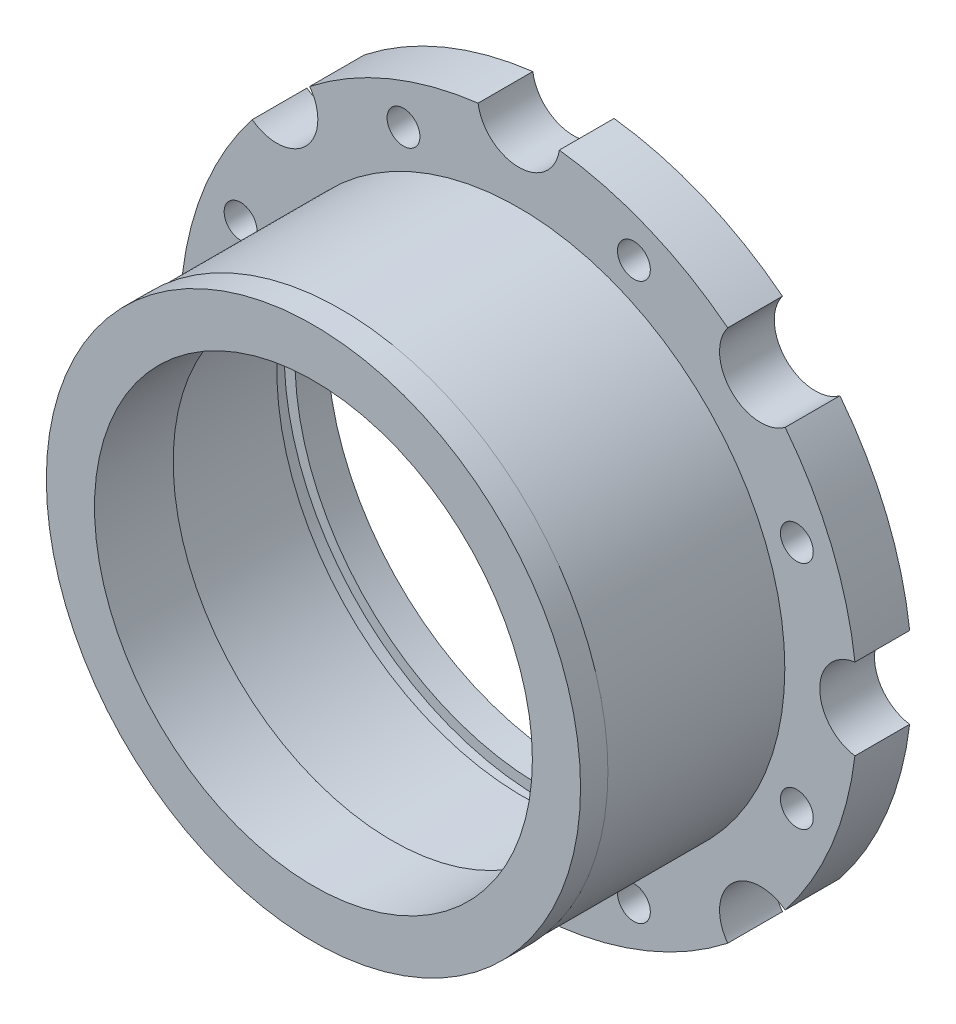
ISO-10303-21;
HEADER;
FILE_DESCRIPTION(('STEP AP214'),'2;1');
FILE_NAME('part.step','',(''),(''),'','','');
FILE_SCHEMA(('AUTOMOTIVE_DESIGN { 1 0 10303 214 1 1 1 1 }'));
ENDSEC;
DATA;
#1=APPLICATION_CONTEXT('core data for automotive mechanical design processes');
#2=APPLICATION_PROTOCOL_DEFINITION('international standard','automotive_design',2000,#1);
#3=PRODUCT_CONTEXT('',#1,'mechanical');
#4=PRODUCT('Part','Part','',(#3));
#5=PRODUCT_RELATED_PRODUCT_CATEGORY('part','',(#4));
#6=PRODUCT_DEFINITION_FORMATION('','',#4);
#7=PRODUCT_DEFINITION_CONTEXT('part definition',#1,'design');
#8=PRODUCT_DEFINITION('design','',#6,#7);
#9=PRODUCT_DEFINITION_SHAPE('','',#8);
#10=(LENGTH_UNIT() NAMED_UNIT(*) SI_UNIT(.MILLI.,.METRE.));
#11=(NAMED_UNIT(*) PLANE_ANGLE_UNIT() SI_UNIT($,.RADIAN.));
#12=(NAMED_UNIT(*) SI_UNIT($,.STERADIAN.) SOLID_ANGLE_UNIT());
#13=UNCERTAINTY_MEASURE_WITH_UNIT(LENGTH_MEASURE(1.E-05),#10,'distance_accuracy_value','');
#14=(GEOMETRIC_REPRESENTATION_CONTEXT(3) GLOBAL_UNCERTAINTY_ASSIGNED_CONTEXT((#13)) GLOBAL_UNIT_ASSIGNED_CONTEXT((#10,
#11,#12)) REPRESENTATION_CONTEXT('',''));
#15=CARTESIAN_POINT('',(0.,0.,0.));
#16=DIRECTION('',(0.,0.,1.));
#17=DIRECTION('',(1.,0.,0.));
#18=AXIS2_PLACEMENT_3D('',#15,#16,#17);
#19=CARTESIAN_POINT('',(0.,0.,4.7));
#20=DIRECTION('',(0.,0.,1.));
#21=DIRECTION('',(1.,0.,0.));
#22=AXIS2_PLACEMENT_3D('',#19,#20,#21);
#23=PLANE('',#22);
#24=CARTESIAN_POINT('',(0.,0.,4.7));
#25=DIRECTION('',(0.,0.,1.));
#26=DIRECTION('',(1.,0.,0.));
#27=AXIS2_PLACEMENT_3D('',#24,#25,#26);
#28=CIRCLE('',#27,36.);
#29=CARTESIAN_POINT('',(36.,0.,4.7));
#30=VERTEX_POINT('',#29);
#31=EDGE_CURVE('E9',#30,#30,#28,.T.);
#32=ORIENTED_EDGE('',*,*,#31,.F.);
#33=EDGE_LOOP('',(#32));
#34=FACE_BOUND('',#33,.T.);
#35=CARTESIAN_POINT('',(0.,0.,4.7));
#36=DIRECTION('',(0.,0.,1.));
#37=DIRECTION('',(1.,0.,0.));
#38=AXIS2_PLACEMENT_3D('',#35,#36,#37);
#39=CIRCLE('',#38,37.575);
#40=CARTESIAN_POINT('',(37.575,0.,4.7));
#41=VERTEX_POINT('',#40);
#42=EDGE_CURVE('E41',#41,#41,#39,.T.);
#43=ORIENTED_EDGE('',*,*,#42,.T.);
#44=EDGE_LOOP('',(#43));
#45=FACE_BOUND('',#44,.T.);
#46=ADVANCED_FACE('F15',(#34,#45),#23,.T.);
#47=CARTESIAN_POINT('',(0.,0.,-0.1));
#48=DIRECTION('',(0.,0.,1.));
#49=DIRECTION('',(1.,0.,0.));
#50=AXIS2_PLACEMENT_3D('',#47,#48,#49);
#51=CYLINDRICAL_SURFACE('',#50,36.);
#52=DIRECTION('',(0.,0.,1.));
#53=VECTOR('',#52,1.);
#54=CARTESIAN_POINT('',(36.,0.,-0.1));
#55=LINE('',#54,#53);
#56=CARTESIAN_POINT('',(36.,0.,0.));
#57=VERTEX_POINT('',#56);
#58=EDGE_CURVE('E18',#57,#30,#55,.T.);
#59=ORIENTED_EDGE('',*,*,#58,.T.);
#60=ORIENTED_EDGE('',*,*,#31,.T.);
#61=ORIENTED_EDGE('',*,*,#58,.F.);
#62=CARTESIAN_POINT('',(0.,0.,0.));
#63=DIRECTION('',(0.,0.,1.));
#64=DIRECTION('',(1.,0.,0.));
#65=AXIS2_PLACEMENT_3D('',#62,#63,#64);
#66=CIRCLE('',#65,36.);
#67=EDGE_CURVE('E446',#57,#57,#66,.T.);
#68=ORIENTED_EDGE('',*,*,#67,.F.);
#69=EDGE_LOOP('',(#59,#60,#61,#68));
#70=FACE_BOUND('',#69,.T.);
#71=ADVANCED_FACE('F528',(#70),#51,.F.);
#72=CARTESIAN_POINT('',(0.,0.,4.7));
#73=DIRECTION('',(0.,0.,1.));
#74=DIRECTION('',(1.,0.,0.));
#75=AXIS2_PLACEMENT_3D('',#72,#73,#74);
#76=CYLINDRICAL_SURFACE('',#75,37.575);
#77=DIRECTION('',(0.,0.,1.));
#78=VECTOR('',#77,1.);
#79=CARTESIAN_POINT('',(37.575,0.,4.7));
#80=LINE('',#79,#78);
#81=CARTESIAN_POINT('',(37.575,0.,7.35));
#82=VERTEX_POINT('',#81);
#83=EDGE_CURVE('E450',#41,#82,#80,.T.);
#84=ORIENTED_EDGE('',*,*,#83,.F.);
#85=ORIENTED_EDGE('',*,*,#42,.F.);
#86=ORIENTED_EDGE('',*,*,#83,.T.);
#87=CARTESIAN_POINT('',(0.,0.,7.35));
#88=DIRECTION('',(0.,0.,1.));
#89=DIRECTION('',(1.,0.,0.));
#90=AXIS2_PLACEMENT_3D('',#87,#88,#89);
#91=CIRCLE('',#90,37.575);
#92=EDGE_CURVE('E451',#82,#82,#91,.T.);
#93=ORIENTED_EDGE('',*,*,#92,.T.);
#94=EDGE_LOOP('',(#84,#85,#86,#93));
#95=FACE_BOUND('',#94,.T.);
#96=ADVANCED_FACE('F535',(#95),#76,.F.);
#97=CARTESIAN_POINT('',(0.,0.,0.));
#98=DIRECTION('',(0.,0.,1.));
#99=DIRECTION('',(1.,0.,0.));
#100=AXIS2_PLACEMENT_3D('',#97,#98,#99);
#101=PLANE('',#100);
#102=CARTESIAN_POINT('',(16.838071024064,40.650699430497,0.));
#103=DIRECTION('',(0.,0.,1.));
#104=DIRECTION('',(1.,0.,0.));
#105=AXIS2_PLACEMENT_3D('',#102,#103,#104);
#106=CIRCLE('',#105,2.4);
#107=CARTESIAN_POINT('',(19.238071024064,40.650699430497,0.));
#108=VERTEX_POINT('',#107);
#109=EDGE_CURVE('E431',#108,#108,#106,.T.);
#110=ORIENTED_EDGE('',*,*,#109,.T.);
#111=EDGE_LOOP('',(#110));
#112=FACE_BOUND('',#111,.T.);
#113=CARTESIAN_POINT('',(40.650699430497,16.838071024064,0.));
#114=DIRECTION('',(0.,0.,1.));
#115=DIRECTION('',(1.,0.,0.));
#116=AXIS2_PLACEMENT_3D('',#113,#114,#115);
#117=CIRCLE('',#116,2.4);
#118=CARTESIAN_POINT('',(43.050699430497,16.838071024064,0.));
#119=VERTEX_POINT('',#118);
#120=EDGE_CURVE('E435',#119,#119,#117,.T.);
#121=ORIENTED_EDGE('',*,*,#120,.T.);
#122=EDGE_LOOP('',(#121));
#123=FACE_BOUND('',#122,.T.);
#124=ORIENTED_EDGE('',*,*,#67,.T.);
#125=EDGE_LOOP('',(#124));
#126=FACE_BOUND('',#125,.T.);
#127=CARTESIAN_POINT('',(-16.83807102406,40.650699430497,0.));
#128=DIRECTION('',(0.,0.,1.));
#129=DIRECTION('',(1.,0.,0.));
#130=AXIS2_PLACEMENT_3D('',#127,#128,#129);
#131=CIRCLE('',#130,2.4);
#132=CARTESIAN_POINT('',(-14.43807102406,40.650699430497,0.));
#133=VERTEX_POINT('',#132);
#134=EDGE_CURVE('E509',#133,#133,#131,.T.);
#135=ORIENTED_EDGE('',*,*,#134,.T.);
#136=EDGE_LOOP('',(#135));
#137=FACE_BOUND('',#136,.T.);
#138=CARTESIAN_POINT('',(-40.65069943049,16.838071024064,0.));
#139=DIRECTION('',(0.,0.,1.));
#140=DIRECTION('',(1.,0.,0.));
#141=AXIS2_PLACEMENT_3D('',#138,#139,#140);
#142=CIRCLE('',#141,2.4);
#143=CARTESIAN_POINT('',(-38.25069943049,16.838071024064,0.));
#144=VERTEX_POINT('',#143);
#145=EDGE_CURVE('E318',#144,#144,#142,.T.);
#146=ORIENTED_EDGE('',*,*,#145,.T.);
#147=EDGE_LOOP('',(#146));
#148=FACE_BOUND('',#147,.T.);
#149=CARTESIAN_POINT('',(40.650699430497,-16.83807102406,0.));
#150=DIRECTION('',(0.,0.,1.));
#151=DIRECTION('',(1.,0.,0.));
#152=AXIS2_PLACEMENT_3D('',#149,#150,#151);
#153=CIRCLE('',#152,2.4);
#154=CARTESIAN_POINT('',(43.050699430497,-16.83807102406,0.));
#155=VERTEX_POINT('',#154);
#156=EDGE_CURVE('E360',#155,#155,#153,.T.);
#157=ORIENTED_EDGE('',*,*,#156,.T.);
#158=EDGE_LOOP('',(#157));
#159=FACE_BOUND('',#158,.T.);
#160=CARTESIAN_POINT('',(16.838071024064,-40.65069943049,0.));
#161=DIRECTION('',(0.,0.,1.));
#162=DIRECTION('',(1.,0.,0.));
#163=AXIS2_PLACEMENT_3D('',#160,#161,#162);
#164=CIRCLE('',#163,2.4);
#165=CARTESIAN_POINT('',(19.238071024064,-40.65069943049,0.));
#166=VERTEX_POINT('',#165);
#167=EDGE_CURVE('E365',#166,#166,#164,.T.);
#168=ORIENTED_EDGE('',*,*,#167,.T.);
#169=EDGE_LOOP('',(#168));
#170=FACE_BOUND('',#169,.T.);
#171=CARTESIAN_POINT('',(-40.65069943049,-16.83807102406,0.));
#172=DIRECTION('',(0.,0.,1.));
#173=DIRECTION('',(1.,0.,0.));
#174=AXIS2_PLACEMENT_3D('',#171,#172,#173);
#175=CIRCLE('',#174,2.4);
#176=CARTESIAN_POINT('',(-38.25069943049,-16.83807102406,0.));
#177=VERTEX_POINT('',#176);
#178=EDGE_CURVE('E364',#177,#177,#175,.T.);
#179=ORIENTED_EDGE('',*,*,#178,.T.);
#180=EDGE_LOOP('',(#179));
#181=FACE_BOUND('',#180,.T.);
#182=CARTESIAN_POINT('',(-16.83807102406,-40.65069943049,0.));
#183=DIRECTION('',(0.,0.,1.));
#184=DIRECTION('',(1.,0.,0.));
#185=AXIS2_PLACEMENT_3D('',#182,#183,#184);
#186=CIRCLE('',#185,2.4);
#187=CARTESIAN_POINT('',(-14.43807102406,-40.65069943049,0.));
#188=VERTEX_POINT('',#187);
#189=EDGE_CURVE('E373',#188,#188,#186,.T.);
#190=ORIENTED_EDGE('',*,*,#189,.T.);
#191=EDGE_LOOP('',(#190));
#192=FACE_BOUND('',#191,.T.);
#193=CARTESIAN_POINT('',(0.,0.,0.));
#194=DIRECTION('',(0.,0.,1.));
#195=DIRECTION('',(1.,0.,0.));
#196=AXIS2_PLACEMENT_3D('',#193,#194,#195);
#197=CIRCLE('',#196,49.5);
#198=CARTESIAN_POINT('',(38.94808380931,-30.54990617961,0.));
#199=VERTEX_POINT('',#198);
#200=CARTESIAN_POINT('',(49.1425,-5.93840835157,0.));
#201=VERTEX_POINT('',#200);
#202=EDGE_CURVE('E413',#199,#201,#197,.T.);
#203=ORIENTED_EDGE('',*,*,#202,.F.);
#204=CARTESIAN_POINT('',(35.355339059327,-35.35533905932,0.));
#205=DIRECTION('',(0.,0.,1.));
#206=DIRECTION('',(1.,0.,0.));
#207=AXIS2_PLACEMENT_3D('',#204,#205,#206);
#208=CIRCLE('',#207,6.);
#209=CARTESIAN_POINT('',(30.54990617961,-38.94808380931,0.));
#210=VERTEX_POINT('',#209);
#211=EDGE_CURVE('E420',#199,#210,#208,.T.);
#212=ORIENTED_EDGE('',*,*,#211,.T.);
#213=CARTESIAN_POINT('',(0.,0.,0.));
#214=DIRECTION('',(0.,0.,1.));
#215=DIRECTION('',(1.,0.,0.));
#216=AXIS2_PLACEMENT_3D('',#213,#214,#215);
#217=CIRCLE('',#216,49.5);
#218=CARTESIAN_POINT('',(5.93840835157,-49.1425,0.));
#219=VERTEX_POINT('',#218);
#220=EDGE_CURVE('E385',#219,#210,#217,.T.);
#221=ORIENTED_EDGE('',*,*,#220,.F.);
#222=CARTESIAN_POINT('',(0.,-50.,0.));
#223=DIRECTION('',(0.,0.,1.));
#224=DIRECTION('',(1.,0.,0.));
#225=AXIS2_PLACEMENT_3D('',#222,#223,#224);
#226=CIRCLE('',#225,6.);
#227=CARTESIAN_POINT('',(-5.93840835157,-49.1425,0.));
#228=VERTEX_POINT('',#227);
#229=EDGE_CURVE('E381',#219,#228,#226,.T.);
#230=ORIENTED_EDGE('',*,*,#229,.T.);
#231=CARTESIAN_POINT('',(0.,0.,0.));
#232=DIRECTION('',(0.,0.,1.));
#233=DIRECTION('',(1.,0.,0.));
#234=AXIS2_PLACEMENT_3D('',#231,#232,#233);
#235=CIRCLE('',#234,49.5);
#236=CARTESIAN_POINT('',(-30.54990617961,-38.94808380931,0.));
#237=VERTEX_POINT('',#236);
#238=EDGE_CURVE('E438',#237,#228,#235,.T.);
#239=ORIENTED_EDGE('',*,*,#238,.F.);
#240=CARTESIAN_POINT('',(-35.35533905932,-35.35533905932,0.));
#241=DIRECTION('',(0.,0.,-1.));
#242=DIRECTION('',(-0.598790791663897,0.800905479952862,0.));
#243=AXIS2_PLACEMENT_3D('',#240,#241,#242);
#244=CIRCLE('',#243,6.);
#245=CARTESIAN_POINT('',(-38.94808380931,-30.54990617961,0.));
#246=VERTEX_POINT('',#245);
#247=EDGE_CURVE('E443',#246,#237,#244,.T.);
#248=ORIENTED_EDGE('',*,*,#247,.F.);
#249=CARTESIAN_POINT('',(0.,0.,0.));
#250=DIRECTION('',(0.,0.,1.));
#251=DIRECTION('',(1.,0.,0.));
#252=AXIS2_PLACEMENT_3D('',#249,#250,#251);
#253=CIRCLE('',#252,49.5);
#254=CARTESIAN_POINT('',(-49.1425,-5.93840835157,0.));
#255=VERTEX_POINT('',#254);
#256=EDGE_CURVE('E457',#255,#246,#253,.T.);
#257=ORIENTED_EDGE('',*,*,#256,.F.);
#258=CARTESIAN_POINT('',(-50.,0.,0.));
#259=DIRECTION('',(0.,0.,-1.));
#260=DIRECTION('',(0.142916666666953,0.989734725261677,0.));
#261=AXIS2_PLACEMENT_3D('',#258,#259,#260);
#262=CIRCLE('',#261,6.);
#263=CARTESIAN_POINT('',(-49.1425,5.93840835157,0.));
#264=VERTEX_POINT('',#263);
#265=EDGE_CURVE('E458',#264,#255,#262,.T.);
#266=ORIENTED_EDGE('',*,*,#265,.F.);
#267=CARTESIAN_POINT('',(0.,0.,0.));
#268=DIRECTION('',(0.,0.,1.));
#269=DIRECTION('',(1.,0.,0.));
#270=AXIS2_PLACEMENT_3D('',#267,#268,#269);
#271=CIRCLE('',#270,49.5);
#272=CARTESIAN_POINT('',(-38.94808380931,30.54990617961,0.));
#273=VERTEX_POINT('',#272);
#274=EDGE_CURVE('E462',#273,#264,#271,.T.);
#275=ORIENTED_EDGE('',*,*,#274,.F.);
#276=CARTESIAN_POINT('',(-35.35533905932,35.355339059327,0.));
#277=DIRECTION('',(0.,0.,-1.));
#278=DIRECTION('',(0.800905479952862,0.598790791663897,0.));
#279=AXIS2_PLACEMENT_3D('',#276,#277,#278);
#280=CIRCLE('',#279,6.);
#281=CARTESIAN_POINT('',(-30.54990617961,38.94808380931,0.));
#282=VERTEX_POINT('',#281);
#283=EDGE_CURVE('E287',#282,#273,#280,.T.);
#284=ORIENTED_EDGE('',*,*,#283,.F.);
#285=CARTESIAN_POINT('',(0.,0.,0.));
#286=DIRECTION('',(0.,0.,1.));
#287=DIRECTION('',(1.,0.,0.));
#288=AXIS2_PLACEMENT_3D('',#285,#286,#287);
#289=CIRCLE('',#288,49.5);
#290=CARTESIAN_POINT('',(-5.93840835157,49.1425,0.));
#291=VERTEX_POINT('',#290);
#292=EDGE_CURVE('E288',#291,#282,#289,.T.);
#293=ORIENTED_EDGE('',*,*,#292,.F.);
#294=CARTESIAN_POINT('',(0.,50.,0.));
#295=DIRECTION('',(0.,0.,1.));
#296=DIRECTION('',(1.,0.,0.));
#297=AXIS2_PLACEMENT_3D('',#294,#295,#296);
#298=CIRCLE('',#297,6.);
#299=CARTESIAN_POINT('',(5.93840835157,49.1425,0.));
#300=VERTEX_POINT('',#299);
#301=EDGE_CURVE('E283',#291,#300,#298,.T.);
#302=ORIENTED_EDGE('',*,*,#301,.T.);
#303=CARTESIAN_POINT('',(0.,0.,0.));
#304=DIRECTION('',(0.,0.,1.));
#305=DIRECTION('',(1.,0.,0.));
#306=AXIS2_PLACEMENT_3D('',#303,#304,#305);
#307=CIRCLE('',#306,49.5);
#308=CARTESIAN_POINT('',(30.54990617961,38.94808380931,0.));
#309=VERTEX_POINT('',#308);
#310=EDGE_CURVE('E483',#309,#300,#307,.T.);
#311=ORIENTED_EDGE('',*,*,#310,.F.);
#312=CARTESIAN_POINT('',(35.355339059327,35.355339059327,0.));
#313=DIRECTION('',(0.,0.,1.));
#314=DIRECTION('',(1.,0.,0.));
#315=AXIS2_PLACEMENT_3D('',#312,#313,#314);
#316=CIRCLE('',#315,6.);
#317=CARTESIAN_POINT('',(38.94808380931,30.54990617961,0.));
#318=VERTEX_POINT('',#317);
#319=EDGE_CURVE('E487',#309,#318,#316,.T.);
#320=ORIENTED_EDGE('',*,*,#319,.T.);
#321=CARTESIAN_POINT('',(0.,0.,0.));
#322=DIRECTION('',(0.,0.,1.));
#323=DIRECTION('',(1.,0.,0.));
#324=AXIS2_PLACEMENT_3D('',#321,#322,#323);
#325=CIRCLE('',#324,49.5);
#326=CARTESIAN_POINT('',(49.1425,5.93840835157,0.));
#327=VERTEX_POINT('',#326);
#328=EDGE_CURVE('E492',#327,#318,#325,.T.);
#329=ORIENTED_EDGE('',*,*,#328,.F.);
#330=CARTESIAN_POINT('',(50.,0.,0.));
#331=DIRECTION('',(0.,0.,1.));
#332=DIRECTION('',(1.,0.,0.));
#333=AXIS2_PLACEMENT_3D('',#330,#331,#332);
#334=CIRCLE('',#333,6.);
#335=EDGE_CURVE('E337',#327,#201,#334,.T.);
#336=ORIENTED_EDGE('',*,*,#335,.T.);
#337=EDGE_LOOP('',(#203,#212,#221,#230,#239,#248,#257,#266,#275,#284,#293,#302,#311,#320,#329,#336));
#338=FACE_BOUND('',#337,.T.);
#339=ADVANCED_FACE('F526',(#112,#123,#126,#137,#148,#159,#170,#181,#192,#338),#101,.F.);
#340=CARTESIAN_POINT('',(0.,0.,7.35));
#341=DIRECTION('',(0.,0.,1.));
#342=DIRECTION('',(1.,0.,0.));
#343=AXIS2_PLACEMENT_3D('',#340,#341,#342);
#344=PLANE('',#343);
#345=CARTESIAN_POINT('',(0.,0.,7.35));
#346=DIRECTION('',(0.,0.,1.));
#347=DIRECTION('',(1.,0.,0.));
#348=AXIS2_PLACEMENT_3D('',#345,#346,#347);
#349=CIRCLE('',#348,36.);
#350=CARTESIAN_POINT('',(36.,0.,7.35));
#351=VERTEX_POINT('',#350);
#352=EDGE_CURVE('E406',#351,#351,#349,.T.);
#353=ORIENTED_EDGE('',*,*,#352,.T.);
#354=EDGE_LOOP('',(#353));
#355=FACE_BOUND('',#354,.T.);
#356=ORIENTED_EDGE('',*,*,#92,.F.);
#357=EDGE_LOOP('',(#356));
#358=FACE_BOUND('',#357,.T.);
#359=ADVANCED_FACE('F533',(#355,#358),#344,.F.);
#360=CARTESIAN_POINT('',(16.838071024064,40.650699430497,-0.1));
#361=DIRECTION('',(0.,0.,1.));
#362=DIRECTION('',(1.,0.,0.));
#363=AXIS2_PLACEMENT_3D('',#360,#361,#362);
#364=CYLINDRICAL_SURFACE('',#363,2.4);
#365=DIRECTION('',(0.,0.,1.));
#366=VECTOR('',#365,1.);
#367=CARTESIAN_POINT('',(19.238071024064,40.650699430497,-0.1));
#368=LINE('',#367,#366);
#369=CARTESIAN_POINT('',(19.238071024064,40.650699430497,8.));
#370=VERTEX_POINT('',#369);
#371=EDGE_CURVE('E428',#108,#370,#368,.T.);
#372=ORIENTED_EDGE('',*,*,#371,.F.);
#373=ORIENTED_EDGE('',*,*,#109,.F.);
#374=ORIENTED_EDGE('',*,*,#371,.T.);
#375=CARTESIAN_POINT('',(16.838071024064,40.650699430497,8.));
#376=DIRECTION('',(0.,0.,1.));
#377=DIRECTION('',(1.,0.,0.));
#378=AXIS2_PLACEMENT_3D('',#375,#376,#377);
#379=CIRCLE('',#378,2.4);
#380=EDGE_CURVE('E397',#370,#370,#379,.T.);
#381=ORIENTED_EDGE('',*,*,#380,.T.);
#382=EDGE_LOOP('',(#372,#373,#374,#381));
#383=FACE_BOUND('',#382,.T.);
#384=ADVANCED_FACE('F711',(#383),#364,.F.);
#385=CARTESIAN_POINT('',(40.650699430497,16.838071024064,-0.1));
#386=DIRECTION('',(0.,0.,1.));
#387=DIRECTION('',(1.,0.,0.));
#388=AXIS2_PLACEMENT_3D('',#385,#386,#387);
#389=CYLINDRICAL_SURFACE('',#388,2.4);
#390=DIRECTION('',(0.,0.,1.));
#391=VECTOR('',#390,1.);
#392=CARTESIAN_POINT('',(43.050699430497,16.838071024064,-0.1));
#393=LINE('',#392,#391);
#394=CARTESIAN_POINT('',(43.050699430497,16.838071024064,8.));
#395=VERTEX_POINT('',#394);
#396=EDGE_CURVE('E512',#119,#395,#393,.T.);
#397=ORIENTED_EDGE('',*,*,#396,.F.);
#398=ORIENTED_EDGE('',*,*,#120,.F.);
#399=ORIENTED_EDGE('',*,*,#396,.T.);
#400=CARTESIAN_POINT('',(40.650699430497,16.838071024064,8.));
#401=DIRECTION('',(0.,0.,1.));
#402=DIRECTION('',(1.,0.,0.));
#403=AXIS2_PLACEMENT_3D('',#400,#401,#402);
#404=CIRCLE('',#403,2.4);
#405=EDGE_CURVE('E398',#395,#395,#404,.T.);
#406=ORIENTED_EDGE('',*,*,#405,.T.);
#407=EDGE_LOOP('',(#397,#398,#399,#406));
#408=FACE_BOUND('',#407,.T.);
#409=ADVANCED_FACE('F714',(#408),#389,.F.);
#410=CARTESIAN_POINT('',(-16.83807102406,40.650699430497,-0.1));
#411=DIRECTION('',(0.,0.,1.));
#412=DIRECTION('',(1.,0.,0.));
#413=AXIS2_PLACEMENT_3D('',#410,#411,#412);
#414=CYLINDRICAL_SURFACE('',#413,2.4);
#415=DIRECTION('',(0.,0.,1.));
#416=VECTOR('',#415,1.);
#417=CARTESIAN_POINT('',(-14.43807102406,40.650699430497,-0.1));
#418=LINE('',#417,#416);
#419=CARTESIAN_POINT('',(-14.43807102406,40.650699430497,8.));
#420=VERTEX_POINT('',#419);
#421=EDGE_CURVE('E321',#133,#420,#418,.T.);
#422=ORIENTED_EDGE('',*,*,#421,.F.);
#423=ORIENTED_EDGE('',*,*,#134,.F.);
#424=ORIENTED_EDGE('',*,*,#421,.T.);
#425=CARTESIAN_POINT('',(-16.83807102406,40.650699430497,8.));
#426=DIRECTION('',(0.,0.,1.));
#427=DIRECTION('',(1.,0.,0.));
#428=AXIS2_PLACEMENT_3D('',#425,#426,#427);
#429=CIRCLE('',#428,2.4);
#430=EDGE_CURVE('E393',#420,#420,#429,.T.);
#431=ORIENTED_EDGE('',*,*,#430,.T.);
#432=EDGE_LOOP('',(#422,#423,#424,#431));
#433=FACE_BOUND('',#432,.T.);
#434=ADVANCED_FACE('F716',(#433),#414,.F.);
#435=CARTESIAN_POINT('',(-40.65069943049,16.838071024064,-0.1));
#436=DIRECTION('',(0.,0.,1.));
#437=DIRECTION('',(1.,0.,0.));
#438=AXIS2_PLACEMENT_3D('',#435,#436,#437);
#439=CYLINDRICAL_SURFACE('',#438,2.4);
#440=DIRECTION('',(0.,0.,1.));
#441=VECTOR('',#440,1.);
#442=CARTESIAN_POINT('',(-38.25069943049,16.838071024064,-0.1));
#443=LINE('',#442,#441);
#444=CARTESIAN_POINT('',(-38.25069943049,16.838071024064,8.));
#445=VERTEX_POINT('',#444);
#446=EDGE_CURVE('E325',#144,#445,#443,.T.);
#447=ORIENTED_EDGE('',*,*,#446,.F.);
#448=ORIENTED_EDGE('',*,*,#145,.F.);
#449=ORIENTED_EDGE('',*,*,#446,.T.);
#450=CARTESIAN_POINT('',(-40.65069943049,16.838071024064,8.));
#451=DIRECTION('',(0.,0.,1.));
#452=DIRECTION('',(1.,0.,0.));
#453=AXIS2_PLACEMENT_3D('',#450,#451,#452);
#454=CIRCLE('',#453,2.4);
#455=EDGE_CURVE('E388',#445,#445,#454,.T.);
#456=ORIENTED_EDGE('',*,*,#455,.T.);
#457=EDGE_LOOP('',(#447,#448,#449,#456));
#458=FACE_BOUND('',#457,.T.);
#459=ADVANCED_FACE('F724',(#458),#439,.F.);
#460=CARTESIAN_POINT('',(40.650699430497,-16.83807102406,-0.1));
#461=DIRECTION('',(0.,0.,1.));
#462=DIRECTION('',(1.,0.,0.));
#463=AXIS2_PLACEMENT_3D('',#460,#461,#462);
#464=CYLINDRICAL_SURFACE('',#463,2.4);
#465=DIRECTION('',(0.,0.,1.));
#466=VECTOR('',#465,1.);
#467=CARTESIAN_POINT('',(43.050699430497,-16.83807102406,-0.1));
#468=LINE('',#467,#466);
#469=CARTESIAN_POINT('',(43.050699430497,-16.83807102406,8.));
#470=VERTEX_POINT('',#469);
#471=EDGE_CURVE('E359',#155,#470,#468,.T.);
#472=ORIENTED_EDGE('',*,*,#471,.F.);
#473=ORIENTED_EDGE('',*,*,#156,.F.);
#474=ORIENTED_EDGE('',*,*,#471,.T.);
#475=CARTESIAN_POINT('',(40.650699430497,-16.83807102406,8.));
#476=DIRECTION('',(0.,0.,1.));
#477=DIRECTION('',(1.,0.,0.));
#478=AXIS2_PLACEMENT_3D('',#475,#476,#477);
#479=CIRCLE('',#478,2.4);
#480=EDGE_CURVE('E387',#470,#470,#479,.T.);
#481=ORIENTED_EDGE('',*,*,#480,.T.);
#482=EDGE_LOOP('',(#472,#473,#474,#481));
#483=FACE_BOUND('',#482,.T.);
#484=ADVANCED_FACE('F730',(#483),#464,.F.);
#485=CARTESIAN_POINT('',(16.838071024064,-40.65069943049,-0.1));
#486=DIRECTION('',(0.,0.,1.));
#487=DIRECTION('',(1.,0.,0.));
#488=AXIS2_PLACEMENT_3D('',#485,#486,#487);
#489=CYLINDRICAL_SURFACE('',#488,2.4);
#490=DIRECTION('',(0.,0.,1.));
#491=VECTOR('',#490,1.);
#492=CARTESIAN_POINT('',(19.238071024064,-40.65069943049,-0.1));
#493=LINE('',#492,#491);
#494=CARTESIAN_POINT('',(19.238071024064,-40.65069943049,8.));
#495=VERTEX_POINT('',#494);
#496=EDGE_CURVE('E363',#166,#495,#493,.T.);
#497=ORIENTED_EDGE('',*,*,#496,.F.);
#498=ORIENTED_EDGE('',*,*,#167,.F.);
#499=ORIENTED_EDGE('',*,*,#496,.T.);
#500=CARTESIAN_POINT('',(16.838071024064,-40.65069943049,8.));
#501=DIRECTION('',(0.,0.,1.));
#502=DIRECTION('',(1.,0.,0.));
#503=AXIS2_PLACEMENT_3D('',#500,#501,#502);
#504=CIRCLE('',#503,2.4);
#505=EDGE_CURVE('E380',#495,#495,#504,.T.);
#506=ORIENTED_EDGE('',*,*,#505,.T.);
#507=EDGE_LOOP('',(#497,#498,#499,#506));
#508=FACE_BOUND('',#507,.T.);
#509=ADVANCED_FACE('F735',(#508),#489,.F.);
#510=CARTESIAN_POINT('',(-40.65069943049,-16.83807102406,-0.1));
#511=DIRECTION('',(0.,0.,1.));
#512=DIRECTION('',(1.,0.,0.));
#513=AXIS2_PLACEMENT_3D('',#510,#511,#512);
#514=CYLINDRICAL_SURFACE('',#513,2.4);
#515=DIRECTION('',(0.,0.,1.));
#516=VECTOR('',#515,1.);
#517=CARTESIAN_POINT('',(-38.25069943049,-16.83807102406,-0.1));
#518=LINE('',#517,#516);
#519=CARTESIAN_POINT('',(-38.25069943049,-16.83807102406,8.));
#520=VERTEX_POINT('',#519);
#521=EDGE_CURVE('E367',#177,#520,#518,.T.);
#522=ORIENTED_EDGE('',*,*,#521,.F.);
#523=ORIENTED_EDGE('',*,*,#178,.F.);
#524=ORIENTED_EDGE('',*,*,#521,.T.);
#525=CARTESIAN_POINT('',(-40.65069943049,-16.83807102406,8.));
#526=DIRECTION('',(0.,0.,1.));
#527=DIRECTION('',(1.,0.,0.));
#528=AXIS2_PLACEMENT_3D('',#525,#526,#527);
#529=CIRCLE('',#528,2.4);
#530=EDGE_CURVE('E369',#520,#520,#529,.T.);
#531=ORIENTED_EDGE('',*,*,#530,.T.);
#532=EDGE_LOOP('',(#522,#523,#524,#531));
#533=FACE_BOUND('',#532,.T.);
#534=ADVANCED_FACE('F734',(#533),#514,.F.);
#535=CARTESIAN_POINT('',(-16.83807102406,-40.65069943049,-0.1));
#536=DIRECTION('',(0.,0.,1.));
#537=DIRECTION('',(1.,0.,0.));
#538=AXIS2_PLACEMENT_3D('',#535,#536,#537);
#539=CYLINDRICAL_SURFACE('',#538,2.4);
#540=DIRECTION('',(0.,0.,1.));
#541=VECTOR('',#540,1.);
#542=CARTESIAN_POINT('',(-14.43807102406,-40.65069943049,-0.1));
#543=LINE('',#542,#541);
#544=CARTESIAN_POINT('',(-14.43807102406,-40.65069943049,8.));
#545=VERTEX_POINT('',#544);
#546=EDGE_CURVE('E497',#188,#545,#543,.T.);
#547=ORIENTED_EDGE('',*,*,#546,.F.);
#548=ORIENTED_EDGE('',*,*,#189,.F.);
#549=ORIENTED_EDGE('',*,*,#546,.T.);
#550=CARTESIAN_POINT('',(-16.83807102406,-40.65069943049,8.));
#551=DIRECTION('',(0.,0.,1.));
#552=DIRECTION('',(1.,0.,0.));
#553=AXIS2_PLACEMENT_3D('',#550,#551,#552);
#554=CIRCLE('',#553,2.4);
#555=EDGE_CURVE('E356',#545,#545,#554,.T.);
#556=ORIENTED_EDGE('',*,*,#555,.T.);
#557=EDGE_LOOP('',(#547,#548,#549,#556));
#558=FACE_BOUND('',#557,.T.);
#559=ADVANCED_FACE('F738',(#558),#539,.F.);
#560=CARTESIAN_POINT('',(0.,0.,0.));
#561=DIRECTION('',(0.,0.,1.));
#562=DIRECTION('',(1.,0.,0.));
#563=AXIS2_PLACEMENT_3D('',#560,#561,#562);
#564=CYLINDRICAL_SURFACE('',#563,49.5);
#565=CARTESIAN_POINT('',(0.,0.,8.));
#566=DIRECTION('',(0.,0.,1.));
#567=DIRECTION('',(1.,0.,0.));
#568=AXIS2_PLACEMENT_3D('',#565,#566,#567);
#569=CIRCLE('',#568,49.5);
#570=CARTESIAN_POINT('',(49.1425,5.93840835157,8.));
#571=VERTEX_POINT('',#570);
#572=CARTESIAN_POINT('',(38.94808380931,30.54990617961,8.));
#573=VERTEX_POINT('',#572);
#574=EDGE_CURVE('E581',#571,#573,#569,.T.);
#575=ORIENTED_EDGE('',*,*,#574,.F.);
#576=DIRECTION('',(0.,0.,1.));
#577=VECTOR('',#576,1.);
#578=CARTESIAN_POINT('',(49.1425,5.93840835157,0.));
#579=LINE('',#578,#577);
#580=EDGE_CURVE('E341',#327,#571,#579,.T.);
#581=ORIENTED_EDGE('',*,*,#580,.F.);
#582=ORIENTED_EDGE('',*,*,#328,.T.);
#583=DIRECTION('',(0.,0.,1.));
#584=VECTOR('',#583,1.);
#585=CARTESIAN_POINT('',(38.94808380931,30.54990617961,0.));
#586=LINE('',#585,#584);
#587=EDGE_CURVE('E486',#318,#573,#586,.T.);
#588=ORIENTED_EDGE('',*,*,#587,.T.);
#589=EDGE_LOOP('',(#575,#581,#582,#588));
#590=FACE_BOUND('',#589,.T.);
#591=ADVANCED_FACE('F743',(#590),#564,.T.);
#592=CARTESIAN_POINT('',(35.355339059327,35.355339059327,-0.1));
#593=DIRECTION('',(0.,0.,1.));
#594=DIRECTION('',(1.,0.,0.));
#595=AXIS2_PLACEMENT_3D('',#592,#593,#594);
#596=CYLINDRICAL_SURFACE('',#595,6.);
#597=ORIENTED_EDGE('',*,*,#587,.F.);
#598=ORIENTED_EDGE('',*,*,#319,.F.);
#599=DIRECTION('',(0.,0.,1.));
#600=VECTOR('',#599,1.);
#601=CARTESIAN_POINT('',(30.54990617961,38.94808380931,0.));
#602=LINE('',#601,#600);
#603=CARTESIAN_POINT('',(30.54990617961,38.94808380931,8.));
#604=VERTEX_POINT('',#603);
#605=EDGE_CURVE('E477',#309,#604,#602,.T.);
#606=ORIENTED_EDGE('',*,*,#605,.T.);
#607=CARTESIAN_POINT('',(35.355339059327,35.355339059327,8.));
#608=DIRECTION('',(0.,0.,1.));
#609=DIRECTION('',(1.,0.,0.));
#610=AXIS2_PLACEMENT_3D('',#607,#608,#609);
#611=CIRCLE('',#610,6.);
#612=EDGE_CURVE('E315',#604,#573,#611,.T.);
#613=ORIENTED_EDGE('',*,*,#612,.T.);
#614=EDGE_LOOP('',(#597,#598,#606,#613));
#615=FACE_BOUND('',#614,.T.);
#616=ADVANCED_FACE('F747',(#615),#596,.F.);
#617=CARTESIAN_POINT('',(0.,0.,0.));
#618=DIRECTION('',(0.,0.,1.));
#619=DIRECTION('',(1.,0.,0.));
#620=AXIS2_PLACEMENT_3D('',#617,#618,#619);
#621=CYLINDRICAL_SURFACE('',#620,49.5);
#622=CARTESIAN_POINT('',(0.,0.,8.));
#623=DIRECTION('',(0.,0.,1.));
#624=DIRECTION('',(1.,0.,0.));
#625=AXIS2_PLACEMENT_3D('',#622,#623,#624);
#626=CIRCLE('',#625,49.5);
#627=CARTESIAN_POINT('',(5.93840835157,49.1425,8.));
#628=VERTEX_POINT('',#627);
#629=EDGE_CURVE('E308',#604,#628,#626,.T.);
#630=ORIENTED_EDGE('',*,*,#629,.F.);
#631=ORIENTED_EDGE('',*,*,#605,.F.);
#632=ORIENTED_EDGE('',*,*,#310,.T.);
#633=DIRECTION('',(0.,0.,1.));
#634=VECTOR('',#633,1.);
#635=CARTESIAN_POINT('',(5.93840835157,49.1425,0.));
#636=LINE('',#635,#634);
#637=EDGE_CURVE('E480',#300,#628,#636,.T.);
#638=ORIENTED_EDGE('',*,*,#637,.T.);
#639=EDGE_LOOP('',(#630,#631,#632,#638));
#640=FACE_BOUND('',#639,.T.);
#641=ADVANCED_FACE('F753',(#640),#621,.T.);
#642=CARTESIAN_POINT('',(0.,50.,-0.1));
#643=DIRECTION('',(0.,0.,1.));
#644=DIRECTION('',(1.,0.,0.));
#645=AXIS2_PLACEMENT_3D('',#642,#643,#644);
#646=CYLINDRICAL_SURFACE('',#645,6.);
#647=ORIENTED_EDGE('',*,*,#637,.F.);
#648=ORIENTED_EDGE('',*,*,#301,.F.);
#649=DIRECTION('',(0.,0.,1.));
#650=VECTOR('',#649,1.);
#651=CARTESIAN_POINT('',(-5.93840835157,49.1425,0.));
#652=LINE('',#651,#650);
#653=CARTESIAN_POINT('',(-5.93840835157,49.1425,8.));
#654=VERTEX_POINT('',#653);
#655=EDGE_CURVE('E277',#291,#654,#652,.T.);
#656=ORIENTED_EDGE('',*,*,#655,.T.);
#657=CARTESIAN_POINT('',(0.,50.,8.));
#658=DIRECTION('',(0.,0.,1.));
#659=DIRECTION('',(1.,0.,0.));
#660=AXIS2_PLACEMENT_3D('',#657,#658,#659);
#661=CIRCLE('',#660,6.);
#662=EDGE_CURVE('E281',#654,#628,#661,.T.);
#663=ORIENTED_EDGE('',*,*,#662,.T.);
#664=EDGE_LOOP('',(#647,#648,#656,#663));
#665=FACE_BOUND('',#664,.T.);
#666=ADVANCED_FACE('F276',(#665),#646,.F.);
#667=CARTESIAN_POINT('',(0.,0.,0.));
#668=DIRECTION('',(0.,0.,1.));
#669=DIRECTION('',(1.,0.,0.));
#670=AXIS2_PLACEMENT_3D('',#667,#668,#669);
#671=CYLINDRICAL_SURFACE('',#670,49.5);
#672=CARTESIAN_POINT('',(0.,0.,8.));
#673=DIRECTION('',(0.,0.,1.));
#674=DIRECTION('',(1.,0.,0.));
#675=AXIS2_PLACEMENT_3D('',#672,#673,#674);
#676=CIRCLE('',#675,49.5);
#677=CARTESIAN_POINT('',(-30.54990617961,38.94808380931,8.));
#678=VERTEX_POINT('',#677);
#679=EDGE_CURVE('E291',#654,#678,#676,.T.);
#680=ORIENTED_EDGE('',*,*,#679,.F.);
#681=ORIENTED_EDGE('',*,*,#655,.F.);
#682=ORIENTED_EDGE('',*,*,#292,.T.);
#683=DIRECTION('',(0.,0.,1.));
#684=VECTOR('',#683,1.);
#685=CARTESIAN_POINT('',(-30.54990617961,38.94808380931,0.));
#686=LINE('',#685,#684);
#687=EDGE_CURVE('E294',#282,#678,#686,.T.);
#688=ORIENTED_EDGE('',*,*,#687,.T.);
#689=EDGE_LOOP('',(#680,#681,#682,#688));
#690=FACE_BOUND('',#689,.T.);
#691=ADVANCED_FACE('F293',(#690),#671,.T.);
#692=CARTESIAN_POINT('',(-35.35533905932,35.355339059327,-0.1));
#693=DIRECTION('',(0.,0.,1.));
#694=DIRECTION('',(1.,0.,0.));
#695=AXIS2_PLACEMENT_3D('',#692,#693,#694);
#696=CYLINDRICAL_SURFACE('',#695,6.);
#697=DIRECTION('',(0.,0.,1.));
#698=VECTOR('',#697,1.);
#699=CARTESIAN_POINT('',(-38.94808380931,30.54990617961,0.));
#700=LINE('',#699,#698);
#701=CARTESIAN_POINT('',(-38.94808380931,30.54990617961,8.));
#702=VERTEX_POINT('',#701);
#703=EDGE_CURVE('E459',#273,#702,#700,.T.);
#704=ORIENTED_EDGE('',*,*,#703,.T.);
#705=CARTESIAN_POINT('',(-35.35533905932,35.355339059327,8.));
#706=DIRECTION('',(0.,0.,-1.));
#707=DIRECTION('',(0.800905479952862,0.598790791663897,0.));
#708=AXIS2_PLACEMENT_3D('',#705,#706,#707);
#709=CIRCLE('',#708,6.);
#710=EDGE_CURVE('E299',#678,#702,#709,.T.);
#711=ORIENTED_EDGE('',*,*,#710,.F.);
#712=ORIENTED_EDGE('',*,*,#687,.F.);
#713=ORIENTED_EDGE('',*,*,#283,.T.);
#714=EDGE_LOOP('',(#704,#711,#712,#713));
#715=FACE_BOUND('',#714,.T.);
#716=ADVANCED_FACE('F759',(#715),#696,.F.);
#717=CARTESIAN_POINT('',(0.,0.,0.));
#718=DIRECTION('',(0.,0.,1.));
#719=DIRECTION('',(1.,0.,0.));
#720=AXIS2_PLACEMENT_3D('',#717,#718,#719);
#721=CYLINDRICAL_SURFACE('',#720,49.5);
#722=CARTESIAN_POINT('',(0.,0.,8.));
#723=DIRECTION('',(0.,0.,1.));
#724=DIRECTION('',(1.,0.,0.));
#725=AXIS2_PLACEMENT_3D('',#722,#723,#724);
#726=CIRCLE('',#725,49.5);
#727=CARTESIAN_POINT('',(-49.1425,5.93840835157,8.));
#728=VERTEX_POINT('',#727);
#729=EDGE_CURVE('E327',#702,#728,#726,.T.);
#730=ORIENTED_EDGE('',*,*,#729,.F.);
#731=ORIENTED_EDGE('',*,*,#703,.F.);
#732=ORIENTED_EDGE('',*,*,#274,.T.);
#733=DIRECTION('',(0.,0.,1.));
#734=VECTOR('',#733,1.);
#735=CARTESIAN_POINT('',(-49.1425,5.93840835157,0.));
#736=LINE('',#735,#734);
#737=EDGE_CURVE('E454',#264,#728,#736,.T.);
#738=ORIENTED_EDGE('',*,*,#737,.T.);
#739=EDGE_LOOP('',(#730,#731,#732,#738));
#740=FACE_BOUND('',#739,.T.);
#741=ADVANCED_FACE('F666',(#740),#721,.T.);
#742=CARTESIAN_POINT('',(-50.,0.,-0.1));
#743=DIRECTION('',(0.,0.,1.));
#744=DIRECTION('',(1.,0.,0.));
#745=AXIS2_PLACEMENT_3D('',#742,#743,#744);
#746=CYLINDRICAL_SURFACE('',#745,6.);
#747=DIRECTION('',(0.,0.,1.));
#748=VECTOR('',#747,1.);
#749=CARTESIAN_POINT('',(-49.1425,-5.93840835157,0.));
#750=LINE('',#749,#748);
#751=CARTESIAN_POINT('',(-49.1425,-5.93840835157,8.));
#752=VERTEX_POINT('',#751);
#753=EDGE_CURVE('E452',#255,#752,#750,.T.);
#754=ORIENTED_EDGE('',*,*,#753,.T.);
#755=CARTESIAN_POINT('',(-50.,0.,8.));
#756=DIRECTION('',(0.,0.,-1.));
#757=DIRECTION('',(0.142916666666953,0.989734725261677,0.));
#758=AXIS2_PLACEMENT_3D('',#755,#756,#757);
#759=CIRCLE('',#758,6.);
#760=EDGE_CURVE('E323',#728,#752,#759,.T.);
#761=ORIENTED_EDGE('',*,*,#760,.F.);
#762=ORIENTED_EDGE('',*,*,#737,.F.);
#763=ORIENTED_EDGE('',*,*,#265,.T.);
#764=EDGE_LOOP('',(#754,#761,#762,#763));
#765=FACE_BOUND('',#764,.T.);
#766=ADVANCED_FACE('F654',(#765),#746,.F.);
#767=CARTESIAN_POINT('',(0.,0.,0.));
#768=DIRECTION('',(0.,0.,1.));
#769=DIRECTION('',(1.,0.,0.));
#770=AXIS2_PLACEMENT_3D('',#767,#768,#769);
#771=CYLINDRICAL_SURFACE('',#770,49.5);
#772=CARTESIAN_POINT('',(0.,0.,8.));
#773=DIRECTION('',(0.,0.,1.));
#774=DIRECTION('',(1.,0.,0.));
#775=AXIS2_PLACEMENT_3D('',#772,#773,#774);
#776=CIRCLE('',#775,49.5);
#777=CARTESIAN_POINT('',(-38.94808380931,-30.54990617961,8.));
#778=VERTEX_POINT('',#777);
#779=EDGE_CURVE('E330',#752,#778,#776,.T.);
#780=ORIENTED_EDGE('',*,*,#779,.F.);
#781=ORIENTED_EDGE('',*,*,#753,.F.);
#782=ORIENTED_EDGE('',*,*,#256,.T.);
#783=DIRECTION('',(0.,0.,1.));
#784=VECTOR('',#783,1.);
#785=CARTESIAN_POINT('',(-38.94808380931,-30.54990617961,0.));
#786=LINE('',#785,#784);
#787=EDGE_CURVE('E445',#246,#778,#786,.T.);
#788=ORIENTED_EDGE('',*,*,#787,.T.);
#789=EDGE_LOOP('',(#780,#781,#782,#788));
#790=FACE_BOUND('',#789,.T.);
#791=ADVANCED_FACE('F659',(#790),#771,.T.);
#792=CARTESIAN_POINT('',(-35.35533905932,-35.35533905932,-0.1));
#793=DIRECTION('',(0.,0.,1.));
#794=DIRECTION('',(1.,0.,0.));
#795=AXIS2_PLACEMENT_3D('',#792,#793,#794);
#796=CYLINDRICAL_SURFACE('',#795,6.);
#797=DIRECTION('',(0.,0.,1.));
#798=VECTOR('',#797,1.);
#799=CARTESIAN_POINT('',(-30.54990617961,-38.94808380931,0.));
#800=LINE('',#799,#798);
#801=CARTESIAN_POINT('',(-30.54990617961,-38.94808380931,8.));
#802=VERTEX_POINT('',#801);
#803=EDGE_CURVE('E436',#237,#802,#800,.T.);
#804=ORIENTED_EDGE('',*,*,#803,.T.);
#805=CARTESIAN_POINT('',(-35.35533905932,-35.35533905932,8.));
#806=DIRECTION('',(0.,0.,-1.));
#807=DIRECTION('',(-0.598790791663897,0.800905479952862,0.));
#808=AXIS2_PLACEMENT_3D('',#805,#806,#807);
#809=CIRCLE('',#808,6.);
#810=EDGE_CURVE('E335',#778,#802,#809,.T.);
#811=ORIENTED_EDGE('',*,*,#810,.F.);
#812=ORIENTED_EDGE('',*,*,#787,.F.);
#813=ORIENTED_EDGE('',*,*,#247,.T.);
#814=EDGE_LOOP('',(#804,#811,#812,#813));
#815=FACE_BOUND('',#814,.T.);
#816=ADVANCED_FACE('F673',(#815),#796,.F.);
#817=CARTESIAN_POINT('',(0.,0.,0.));
#818=DIRECTION('',(0.,0.,1.));
#819=DIRECTION('',(1.,0.,0.));
#820=AXIS2_PLACEMENT_3D('',#817,#818,#819);
#821=CYLINDRICAL_SURFACE('',#820,49.5);
#822=CARTESIAN_POINT('',(0.,0.,8.));
#823=DIRECTION('',(0.,0.,1.));
#824=DIRECTION('',(1.,0.,0.));
#825=AXIS2_PLACEMENT_3D('',#822,#823,#824);
#826=CIRCLE('',#825,49.5);
#827=CARTESIAN_POINT('',(-5.93840835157,-49.1425,8.));
#828=VERTEX_POINT('',#827);
#829=EDGE_CURVE('E336',#802,#828,#826,.T.);
#830=ORIENTED_EDGE('',*,*,#829,.F.);
#831=ORIENTED_EDGE('',*,*,#803,.F.);
#832=ORIENTED_EDGE('',*,*,#238,.T.);
#833=DIRECTION('',(0.,0.,1.));
#834=VECTOR('',#833,1.);
#835=CARTESIAN_POINT('',(-5.93840835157,-49.1425,0.));
#836=LINE('',#835,#834);
#837=EDGE_CURVE('E378',#228,#828,#836,.T.);
#838=ORIENTED_EDGE('',*,*,#837,.T.);
#839=EDGE_LOOP('',(#830,#831,#832,#838));
#840=FACE_BOUND('',#839,.T.);
#841=ADVANCED_FACE('F676',(#840),#821,.T.);
#842=CARTESIAN_POINT('',(0.,-50.,-0.1));
#843=DIRECTION('',(0.,0.,1.));
#844=DIRECTION('',(1.,0.,0.));
#845=AXIS2_PLACEMENT_3D('',#842,#843,#844);
#846=CYLINDRICAL_SURFACE('',#845,6.);
#847=ORIENTED_EDGE('',*,*,#837,.F.);
#848=ORIENTED_EDGE('',*,*,#229,.F.);
#849=DIRECTION('',(0.,0.,1.));
#850=VECTOR('',#849,1.);
#851=CARTESIAN_POINT('',(5.93840835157,-49.1425,0.));
#852=LINE('',#851,#850);
#853=CARTESIAN_POINT('',(5.93840835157,-49.1425,8.));
#854=VERTEX_POINT('',#853);
#855=EDGE_CURVE('E421',#219,#854,#852,.T.);
#856=ORIENTED_EDGE('',*,*,#855,.T.);
#857=CARTESIAN_POINT('',(0.,-50.,8.));
#858=DIRECTION('',(0.,0.,1.));
#859=DIRECTION('',(1.,0.,0.));
#860=AXIS2_PLACEMENT_3D('',#857,#858,#859);
#861=CIRCLE('',#860,6.);
#862=EDGE_CURVE('E348',#854,#828,#861,.T.);
#863=ORIENTED_EDGE('',*,*,#862,.T.);
#864=EDGE_LOOP('',(#847,#848,#856,#863));
#865=FACE_BOUND('',#864,.T.);
#866=ADVANCED_FACE('F679',(#865),#846,.F.);
#867=CARTESIAN_POINT('',(0.,0.,0.));
#868=DIRECTION('',(0.,0.,1.));
#869=DIRECTION('',(1.,0.,0.));
#870=AXIS2_PLACEMENT_3D('',#867,#868,#869);
#871=CYLINDRICAL_SURFACE('',#870,49.5);
#872=CARTESIAN_POINT('',(0.,0.,8.));
#873=DIRECTION('',(0.,0.,1.));
#874=DIRECTION('',(1.,0.,0.));
#875=AXIS2_PLACEMENT_3D('',#872,#873,#874);
#876=CIRCLE('',#875,49.5);
#877=CARTESIAN_POINT('',(30.54990617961,-38.94808380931,8.));
#878=VERTEX_POINT('',#877);
#879=EDGE_CURVE('E343',#854,#878,#876,.T.);
#880=ORIENTED_EDGE('',*,*,#879,.F.);
#881=ORIENTED_EDGE('',*,*,#855,.F.);
#882=ORIENTED_EDGE('',*,*,#220,.T.);
#883=DIRECTION('',(0.,0.,1.));
#884=VECTOR('',#883,1.);
#885=CARTESIAN_POINT('',(30.54990617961,-38.94808380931,0.));
#886=LINE('',#885,#884);
#887=EDGE_CURVE('E418',#210,#878,#886,.T.);
#888=ORIENTED_EDGE('',*,*,#887,.T.);
#889=EDGE_LOOP('',(#880,#881,#882,#888));
#890=FACE_BOUND('',#889,.T.);
#891=ADVANCED_FACE('F683',(#890),#871,.T.);
#892=CARTESIAN_POINT('',(35.355339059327,-35.35533905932,-0.1));
#893=DIRECTION('',(0.,0.,1.));
#894=DIRECTION('',(1.,0.,0.));
#895=AXIS2_PLACEMENT_3D('',#892,#893,#894);
#896=CYLINDRICAL_SURFACE('',#895,6.);
#897=ORIENTED_EDGE('',*,*,#887,.F.);
#898=ORIENTED_EDGE('',*,*,#211,.F.);
#899=DIRECTION('',(0.,0.,1.));
#900=VECTOR('',#899,1.);
#901=CARTESIAN_POINT('',(38.94808380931,-30.54990617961,0.));
#902=LINE('',#901,#900);
#903=CARTESIAN_POINT('',(38.94808380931,-30.54990617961,8.));
#904=VERTEX_POINT('',#903);
#905=EDGE_CURVE('E312',#199,#904,#902,.T.);
#906=ORIENTED_EDGE('',*,*,#905,.T.);
#907=CARTESIAN_POINT('',(35.355339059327,-35.35533905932,8.));
#908=DIRECTION('',(0.,0.,1.));
#909=DIRECTION('',(1.,0.,0.));
#910=AXIS2_PLACEMENT_3D('',#907,#908,#909);
#911=CIRCLE('',#910,6.);
#912=EDGE_CURVE('E346',#904,#878,#911,.T.);
#913=ORIENTED_EDGE('',*,*,#912,.T.);
#914=EDGE_LOOP('',(#897,#898,#906,#913));
#915=FACE_BOUND('',#914,.T.);
#916=ADVANCED_FACE('F684',(#915),#896,.F.);
#917=CARTESIAN_POINT('',(0.,0.,0.));
#918=DIRECTION('',(0.,0.,1.));
#919=DIRECTION('',(1.,0.,0.));
#920=AXIS2_PLACEMENT_3D('',#917,#918,#919);
#921=CYLINDRICAL_SURFACE('',#920,49.5);
#922=CARTESIAN_POINT('',(0.,0.,8.));
#923=DIRECTION('',(0.,0.,1.));
#924=DIRECTION('',(1.,0.,0.));
#925=AXIS2_PLACEMENT_3D('',#922,#923,#924);
#926=CIRCLE('',#925,49.5);
#927=CARTESIAN_POINT('',(49.1425,-5.93840835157,8.));
#928=VERTEX_POINT('',#927);
#929=EDGE_CURVE('E355',#904,#928,#926,.T.);
#930=ORIENTED_EDGE('',*,*,#929,.F.);
#931=ORIENTED_EDGE('',*,*,#905,.F.);
#932=ORIENTED_EDGE('',*,*,#202,.T.);
#933=DIRECTION('',(0.,0.,1.));
#934=VECTOR('',#933,1.);
#935=CARTESIAN_POINT('',(49.1425,-5.93840835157,0.));
#936=LINE('',#935,#934);
#937=EDGE_CURVE('E345',#201,#928,#936,.T.);
#938=ORIENTED_EDGE('',*,*,#937,.T.);
#939=EDGE_LOOP('',(#930,#931,#932,#938));
#940=FACE_BOUND('',#939,.T.);
#941=ADVANCED_FACE('F553',(#940),#921,.T.);
#942=CARTESIAN_POINT('',(50.,0.,-0.1));
#943=DIRECTION('',(0.,0.,1.));
#944=DIRECTION('',(1.,0.,0.));
#945=AXIS2_PLACEMENT_3D('',#942,#943,#944);
#946=CYLINDRICAL_SURFACE('',#945,6.);
#947=ORIENTED_EDGE('',*,*,#937,.F.);
#948=ORIENTED_EDGE('',*,*,#335,.F.);
#949=ORIENTED_EDGE('',*,*,#580,.T.);
#950=CARTESIAN_POINT('',(50.,0.,8.));
#951=DIRECTION('',(0.,0.,1.));
#952=DIRECTION('',(1.,0.,0.));
#953=AXIS2_PLACEMENT_3D('',#950,#951,#952);
#954=CIRCLE('',#953,6.);
#955=EDGE_CURVE('E570',#571,#928,#954,.T.);
#956=ORIENTED_EDGE('',*,*,#955,.T.);
#957=EDGE_LOOP('',(#947,#948,#949,#956));
#958=FACE_BOUND('',#957,.T.);
#959=ADVANCED_FACE('F691',(#958),#946,.F.);
#960=CARTESIAN_POINT('',(0.,0.,-0.1));
#961=DIRECTION('',(0.,0.,1.));
#962=DIRECTION('',(1.,0.,0.));
#963=AXIS2_PLACEMENT_3D('',#960,#961,#962);
#964=CYLINDRICAL_SURFACE('',#963,36.);
#965=DIRECTION('',(0.,0.,1.));
#966=VECTOR('',#965,1.);
#967=CARTESIAN_POINT('',(36.,0.,-0.1));
#968=LINE('',#967,#966);
#969=CARTESIAN_POINT('',(36.,0.,26.5));
#970=VERTEX_POINT('',#969);
#971=EDGE_CURVE('E403',#351,#970,#968,.T.);
#972=ORIENTED_EDGE('',*,*,#971,.T.);
#973=CARTESIAN_POINT('',(0.,0.,26.5));
#974=DIRECTION('',(0.,0.,1.));
#975=DIRECTION('',(1.,0.,0.));
#976=AXIS2_PLACEMENT_3D('',#973,#974,#975);
#977=CIRCLE('',#976,36.);
#978=EDGE_CURVE('E565',#970,#970,#977,.T.);
#979=ORIENTED_EDGE('',*,*,#978,.T.);
#980=ORIENTED_EDGE('',*,*,#971,.F.);
#981=ORIENTED_EDGE('',*,*,#352,.F.);
#982=EDGE_LOOP('',(#972,#979,#980,#981));
#983=FACE_BOUND('',#982,.T.);
#984=ADVANCED_FACE('F771',(#983),#964,.F.);
#985=CARTESIAN_POINT('',(0.,0.,8.));
#986=DIRECTION('',(0.,0.,1.));
#987=DIRECTION('',(1.,0.,0.));
#988=AXIS2_PLACEMENT_3D('',#985,#986,#987);
#989=PLANE('',#988);
#990=ORIENTED_EDGE('',*,*,#380,.F.);
#991=EDGE_LOOP('',(#990));
#992=FACE_BOUND('',#991,.T.);
#993=ORIENTED_EDGE('',*,*,#405,.F.);
#994=EDGE_LOOP('',(#993));
#995=FACE_BOUND('',#994,.T.);
#996=CARTESIAN_POINT('',(0.,0.,8.));
#997=DIRECTION('',(0.,0.,1.));
#998=DIRECTION('',(1.,0.,0.));
#999=AXIS2_PLACEMENT_3D('',#996,#997,#998);
#1000=CIRCLE('',#999,38.895);
#1001=CARTESIAN_POINT('',(38.895,0.,8.));
#1002=VERTEX_POINT('',#1001);
#1003=EDGE_CURVE('E566',#1002,#1002,#1000,.T.);
#1004=ORIENTED_EDGE('',*,*,#1003,.F.);
#1005=EDGE_LOOP('',(#1004));
#1006=FACE_BOUND('',#1005,.T.);
#1007=ORIENTED_EDGE('',*,*,#430,.F.);
#1008=EDGE_LOOP('',(#1007));
#1009=FACE_BOUND('',#1008,.T.);
#1010=ORIENTED_EDGE('',*,*,#455,.F.);
#1011=EDGE_LOOP('',(#1010));
#1012=FACE_BOUND('',#1011,.T.);
#1013=ORIENTED_EDGE('',*,*,#480,.F.);
#1014=EDGE_LOOP('',(#1013));
#1015=FACE_BOUND('',#1014,.T.);
#1016=ORIENTED_EDGE('',*,*,#505,.F.);
#1017=EDGE_LOOP('',(#1016));
#1018=FACE_BOUND('',#1017,.T.);
#1019=ORIENTED_EDGE('',*,*,#530,.F.);
#1020=EDGE_LOOP('',(#1019));
#1021=FACE_BOUND('',#1020,.T.);
#1022=ORIENTED_EDGE('',*,*,#555,.F.);
#1023=EDGE_LOOP('',(#1022));
#1024=FACE_BOUND('',#1023,.T.);
#1025=ORIENTED_EDGE('',*,*,#955,.F.);
#1026=ORIENTED_EDGE('',*,*,#574,.T.);
#1027=ORIENTED_EDGE('',*,*,#612,.F.);
#1028=ORIENTED_EDGE('',*,*,#629,.T.);
#1029=ORIENTED_EDGE('',*,*,#662,.F.);
#1030=ORIENTED_EDGE('',*,*,#679,.T.);
#1031=ORIENTED_EDGE('',*,*,#710,.T.);
#1032=ORIENTED_EDGE('',*,*,#729,.T.);
#1033=ORIENTED_EDGE('',*,*,#760,.T.);
#1034=ORIENTED_EDGE('',*,*,#779,.T.);
#1035=ORIENTED_EDGE('',*,*,#810,.T.);
#1036=ORIENTED_EDGE('',*,*,#829,.T.);
#1037=ORIENTED_EDGE('',*,*,#862,.F.);
#1038=ORIENTED_EDGE('',*,*,#879,.T.);
#1039=ORIENTED_EDGE('',*,*,#912,.F.);
#1040=ORIENTED_EDGE('',*,*,#929,.T.);
#1041=EDGE_LOOP('',(#1025,#1026,#1027,#1028,#1029,#1030,#1031,#1032,#1033,#1034,#1035,#1036,
#1037,#1038,#1039,#1040));
#1042=FACE_BOUND('',#1041,.T.);
#1043=ADVANCED_FACE('F303',(#992,#995,#1006,#1009,#1012,#1015,#1018,#1021,#1024,#1042),#989,.T.);
#1044=CARTESIAN_POINT('',(0.,0.,26.5));
#1045=DIRECTION('',(0.,0.,1.));
#1046=DIRECTION('',(1.,0.,0.));
#1047=AXIS2_PLACEMENT_3D('',#1044,#1045,#1046);
#1048=PLANE('',#1047);
#1049=CARTESIAN_POINT('',(0.,0.,26.5));
#1050=DIRECTION('',(0.,0.,1.));
#1051=DIRECTION('',(1.,0.,0.));
#1052=AXIS2_PLACEMENT_3D('',#1049,#1050,#1051);
#1053=CIRCLE('',#1052,32.);
#1054=CARTESIAN_POINT('',(32.,0.,26.5));
#1055=VERTEX_POINT('',#1054);
#1056=EDGE_CURVE('E592',#1055,#1055,#1053,.T.);
#1057=ORIENTED_EDGE('',*,*,#1056,.T.);
#1058=EDGE_LOOP('',(#1057));
#1059=FACE_BOUND('',#1058,.T.);
#1060=ORIENTED_EDGE('',*,*,#978,.F.);
#1061=EDGE_LOOP('',(#1060));
#1062=FACE_BOUND('',#1061,.T.);
#1063=ADVANCED_FACE('F778',(#1059,#1062),#1048,.F.);
#1064=CARTESIAN_POINT('',(0.,0.,8.));
#1065=DIRECTION('',(0.,0.,1.));
#1066=DIRECTION('',(1.,0.,0.));
#1067=AXIS2_PLACEMENT_3D('',#1064,#1065,#1066);
#1068=CYLINDRICAL_SURFACE('',#1067,38.895);
#1069=CARTESIAN_POINT('',(0.,0.,34.));
#1070=DIRECTION('',(0.,0.,1.));
#1071=DIRECTION('',(1.,0.,0.));
#1072=AXIS2_PLACEMENT_3D('',#1069,#1070,#1071);
#1073=CIRCLE('',#1072,38.895);
#1074=CARTESIAN_POINT('',(38.895,0.,34.));
#1075=VERTEX_POINT('',#1074);
#1076=EDGE_CURVE('E597',#1075,#1075,#1073,.T.);
#1077=ORIENTED_EDGE('',*,*,#1076,.F.);
#1078=DIRECTION('',(0.,0.,1.));
#1079=VECTOR('',#1078,1.);
#1080=CARTESIAN_POINT('',(38.895,0.,8.));
#1081=LINE('',#1080,#1079);
#1082=EDGE_CURVE('E572',#1002,#1075,#1081,.T.);
#1083=ORIENTED_EDGE('',*,*,#1082,.F.);
#1084=ORIENTED_EDGE('',*,*,#1003,.T.);
#1085=ORIENTED_EDGE('',*,*,#1082,.T.);
#1086=EDGE_LOOP('',(#1077,#1083,#1084,#1085));
#1087=FACE_BOUND('',#1086,.T.);
#1088=ADVANCED_FACE('F782',(#1087),#1068,.T.);
#1089=CARTESIAN_POINT('',(0.,0.,-0.1));
#1090=DIRECTION('',(0.,0.,1.));
#1091=DIRECTION('',(1.,0.,0.));
#1092=AXIS2_PLACEMENT_3D('',#1089,#1090,#1091);
#1093=CYLINDRICAL_SURFACE('',#1092,32.);
#1094=ORIENTED_EDGE('',*,*,#1056,.F.);
#1095=DIRECTION('',(0.,0.,1.));
#1096=VECTOR('',#1095,1.);
#1097=CARTESIAN_POINT('',(32.,0.,-0.1));
#1098=LINE('',#1097,#1096);
#1099=CARTESIAN_POINT('',(32.,0.,38.));
#1100=VERTEX_POINT('',#1099);
#1101=EDGE_CURVE('E580',#1055,#1100,#1098,.T.);
#1102=ORIENTED_EDGE('',*,*,#1101,.T.);
#1103=CARTESIAN_POINT('',(0.,0.,38.));
#1104=DIRECTION('',(0.,0.,1.));
#1105=DIRECTION('',(1.,0.,0.));
#1106=AXIS2_PLACEMENT_3D('',#1103,#1104,#1105);
#1107=CIRCLE('',#1106,32.);
#1108=EDGE_CURVE('E611',#1100,#1100,#1107,.T.);
#1109=ORIENTED_EDGE('',*,*,#1108,.T.);
#1110=ORIENTED_EDGE('',*,*,#1101,.F.);
#1111=EDGE_LOOP('',(#1094,#1102,#1109,#1110));
#1112=FACE_BOUND('',#1111,.T.);
#1113=ADVANCED_FACE('F820',(#1112),#1093,.F.);
#1114=CARTESIAN_POINT('',(0.,0.,34.));
#1115=DIRECTION('',(0.,0.,1.));
#1116=DIRECTION('',(1.,0.,0.));
#1117=AXIS2_PLACEMENT_3D('',#1114,#1115,#1116);
#1118=PLANE('',#1117);
#1119=ORIENTED_EDGE('',*,*,#1076,.T.);
#1120=EDGE_LOOP('',(#1119));
#1121=FACE_BOUND('',#1120,.T.);
#1122=CARTESIAN_POINT('',(0.,0.,34.));
#1123=DIRECTION('',(0.,0.,1.));
#1124=DIRECTION('',(1.,0.,0.));
#1125=AXIS2_PLACEMENT_3D('',#1122,#1123,#1124);
#1126=CIRCLE('',#1125,39.04);
#1127=CARTESIAN_POINT('',(39.04,0.,34.));
#1128=VERTEX_POINT('',#1127);
#1129=EDGE_CURVE('E616',#1128,#1128,#1126,.T.);
#1130=ORIENTED_EDGE('',*,*,#1129,.F.);
#1131=EDGE_LOOP('',(#1130));
#1132=FACE_BOUND('',#1131,.T.);
#1133=ADVANCED_FACE('F813',(#1121,#1132),#1118,.F.);
#1134=CARTESIAN_POINT('',(0.,0.,38.));
#1135=DIRECTION('',(0.,0.,1.));
#1136=DIRECTION('',(1.,0.,0.));
#1137=AXIS2_PLACEMENT_3D('',#1134,#1135,#1136);
#1138=PLANE('',#1137);
#1139=ORIENTED_EDGE('',*,*,#1108,.F.);
#1140=EDGE_LOOP('',(#1139));
#1141=FACE_BOUND('',#1140,.T.);
#1142=CARTESIAN_POINT('',(0.,0.,38.));
#1143=DIRECTION('',(0.,0.,1.));
#1144=DIRECTION('',(1.,0.,0.));
#1145=AXIS2_PLACEMENT_3D('',#1142,#1143,#1144);
#1146=CIRCLE('',#1145,39.04);
#1147=CARTESIAN_POINT('',(39.04,0.,38.));
#1148=VERTEX_POINT('',#1147);
#1149=EDGE_CURVE('E634',#1148,#1148,#1146,.T.);
#1150=ORIENTED_EDGE('',*,*,#1149,.T.);
#1151=EDGE_LOOP('',(#1150));
#1152=FACE_BOUND('',#1151,.T.);
#1153=ADVANCED_FACE('F816',(#1141,#1152),#1138,.T.);
#1154=CARTESIAN_POINT('',(0.,0.,34.));
#1155=DIRECTION('',(0.,0.,1.));
#1156=DIRECTION('',(1.,0.,0.));
#1157=AXIS2_PLACEMENT_3D('',#1154,#1155,#1156);
#1158=CYLINDRICAL_SURFACE('',#1157,39.04);
#1159=ORIENTED_EDGE('',*,*,#1149,.F.);
#1160=DIRECTION('',(0.,0.,1.));
#1161=VECTOR('',#1160,1.);
#1162=CARTESIAN_POINT('',(39.04,0.,34.));
#1163=LINE('',#1162,#1161);
#1164=EDGE_CURVE('E631',#1128,#1148,#1163,.T.);
#1165=ORIENTED_EDGE('',*,*,#1164,.F.);
#1166=ORIENTED_EDGE('',*,*,#1129,.T.);
#1167=ORIENTED_EDGE('',*,*,#1164,.T.);
#1168=EDGE_LOOP('',(#1159,#1165,#1166,#1167));
#1169=FACE_BOUND('',#1168,.T.);
#1170=ADVANCED_FACE('F822',(#1169),#1158,.T.);
#1171=CLOSED_SHELL('',(#46,#71,#96,#339,#359,#384,#409,#434,#459,#484,#509,#534,#559,#591,#616,
#641,#666,#691,#716,#741,#766,#791,#816,#841,#866,#891,#916,#941,#959,#984,#1043,#1063,#1088,
#1113,#1133,#1153,#1170));
#1172=MANIFOLD_SOLID_BREP('B1',#1171);
#1173=ADVANCED_BREP_SHAPE_REPRESENTATION('',(#18,#1172),#14);
#1174=SHAPE_DEFINITION_REPRESENTATION(#9,#1173);
ENDSEC;
END-ISO-10303-21;
